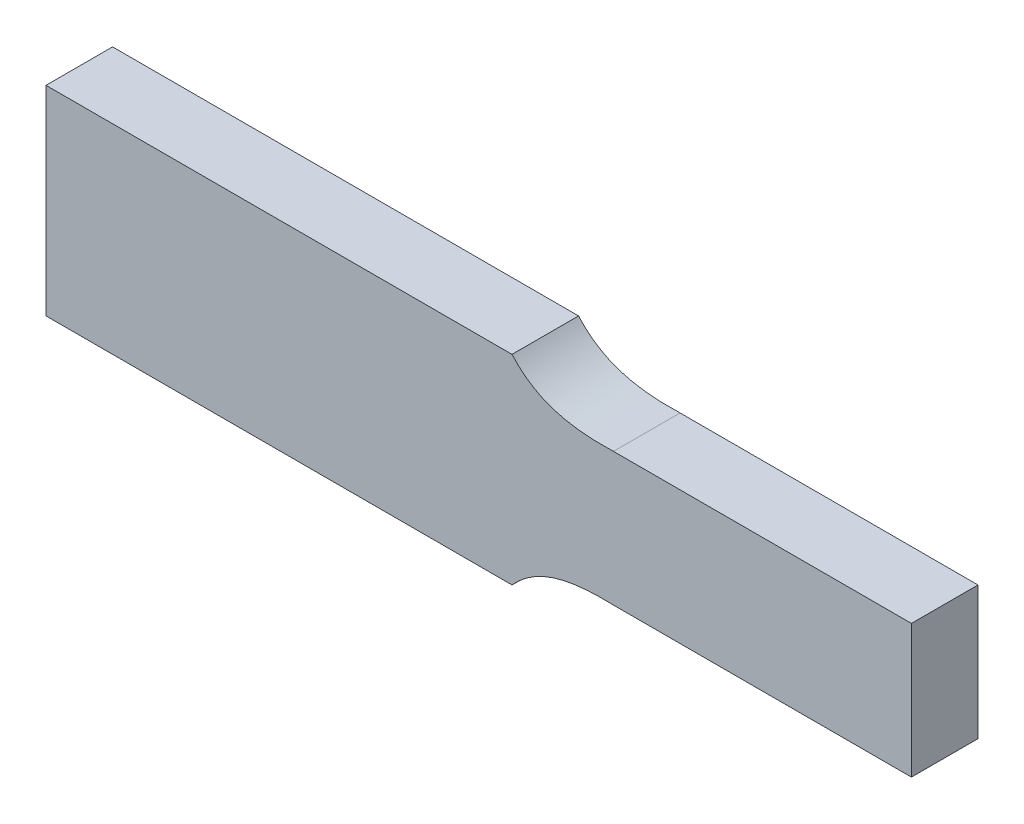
from build123d import *

# Parameters (mm, degrees)
AUFSATZ_LINEAR_AUSTRAGEN1_DEPTH = 20


with BuildPart() as part:
    # Skizze1 → Aufsatz-Linear austragen1 (new body)
    with BuildSketch(Plane.XY):
        with BuildLine():
            Line((0, -18.816972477), (0, 41.183027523))
            Line((0, 41.183027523), (140, 41.183027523))
            add(Edge.make_bspline(
                [(170.489829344, 31.183027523), (162.987656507, 30.945285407), (151.161976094, 31.680621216), (142.236718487, 38.626714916), (140, 41.183027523)],
                knots=[0, 0, 0, 0, 0.691595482, 1, 1, 1, 1], degree=3))
            Line((170.489829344, 31.183027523), (260, 31.183027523))
            Line((260, 31.183027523), (260, -8.816972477))
            Line((260, -8.816972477), (170.489829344, -8.816972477))
            add(Edge.make_bspline(
                [(170.489829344, -8.816972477), (162.987656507, -8.579230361), (151.161976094, -9.31456617), (142.236718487, -16.26065987), (140, -18.816972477)],
                knots=[0, 0, 0, 0, 0.691595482, 1, 1, 1, 1], degree=3))
            Line((140, -18.816972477), (0, -18.816972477))
        make_face()
    extrude(amount=AUFSATZ_LINEAR_AUSTRAGEN1_DEPTH)


solid = part.part
